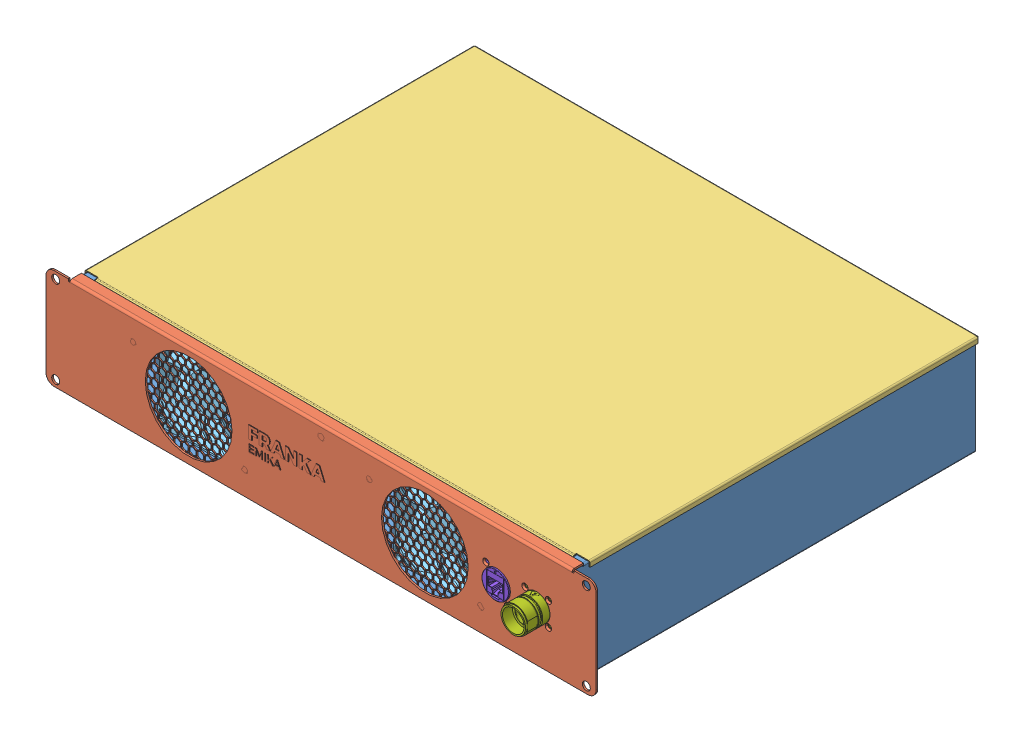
SolidWorks assembly Franka_Control.SLDASM, configuration Standard (file format 11000). Lengths in mm.
Overall size (482 91.82 380.5).
11 component instances, 10 part files, 0 mates.
Components (placement in the parent):
- Housing_Control-1: Housing_Control.SLDPRT [Standard] at (208.765 174.4725 406.0271) size (440 87.01 353.5)
- Housing_Front_Cover_Control-1: Housing_Front_Cover_Control.SLDPRT [Standard] at (232.3164 204.1937 546.9884) size (482 88 12.5)
- Housing_Top_Cover_Control-1: Housing_Top_Cover_Control.SLDPRT [Standard] at (143.743 240.1372 417.5845) x (-1 0 0) z (0 -1 0) size (442.5 352.13 12.22)
- Housing_Cover_Power_Supply_Control-1: Housing_Cover_Power_Supply_Control.SLDPRT [Standard] at (297.2597 157.9872 387.3241) x (0 1 0) z (-1 0 0) size (40.6 3.4 125.4)
- Fan_Control-1: Fan_Control.SLDPRT [Standard] at (95.5763 237.0567 531.2399) x (0 -1 0) z (-1 0 0) size (91.82 27.29 91.82)
- Fan_Control-2: Fan_Control.SLDPRT [Standard] at (302.5763 237.0567 531.2399) x (0 -1 0) z (-1 0 0) size (91.82 27.29 91.82)
- Fan_Power_Supply_Control-1: Fan_Power_Supply_Control.SLDPRT [Standard] at (252.9597 146.2872 387.3241) x (1 0 0) z (0 1 0) size (40 20 40)
- C1_Connection_to_Arm_Connector_Control-1: C1_Connection_to_Arm_Connector_Control.SLDPRT [Standard] at (332.7597 196.2372 600.0241) x (0 1 0) z (1 0 0) size (32.8 69.6 25.61)
- C2_Shop_Floor_Network_Connector_Control-1: C2_Shop_Floor_Network_Connector_Control.SLDPRT [Standard] at (287.8276 193.0092 581.2984) x (-1 0 0) z (0 0 -1) size (26 31 33)
- C3_Power_Connector_Control-1: C3_Power_Connector_Control.SLDPRT [Standard] at (297.2597 157.9872 387.3241) x (0 1 0) z (-1 0 0) size (24 27.2 31)
- Power_Switch_Control-1: Power_Switch_Control.SLDPRT [Standard] at (297.2597 157.9872 387.3241) x (0 1 0) z (-1 0 0) size (22.8 27.5 15)
